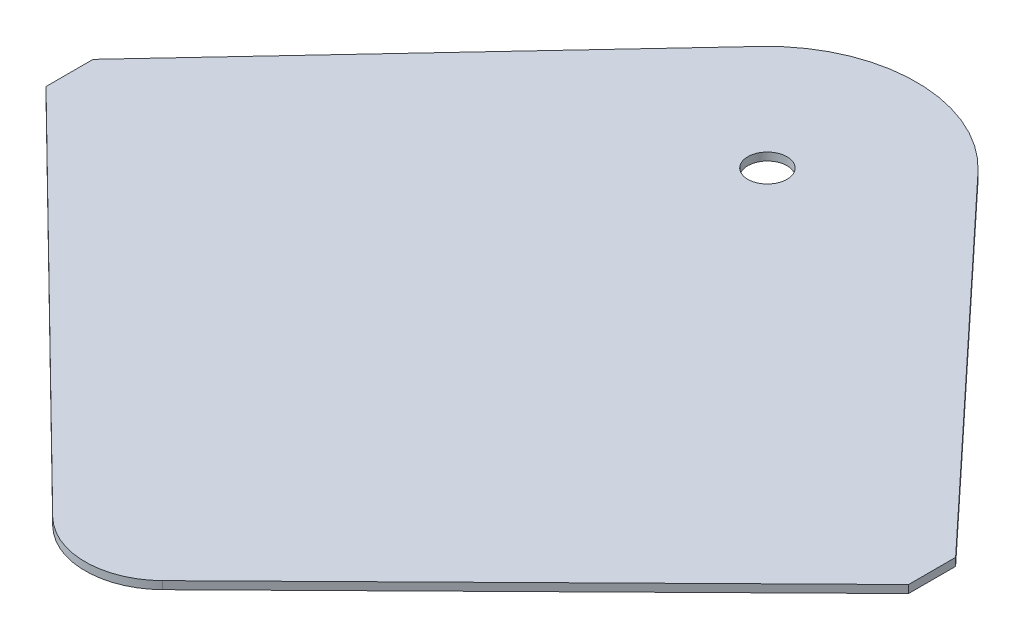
ISO-10303-21;
HEADER;
FILE_DESCRIPTION(('STEP AP214'),'2;1');
FILE_NAME('part.step','',(''),(''),'','','');
FILE_SCHEMA(('AUTOMOTIVE_DESIGN { 1 0 10303 214 1 1 1 1 }'));
ENDSEC;
DATA;
#1=APPLICATION_CONTEXT('core data for automotive mechanical design processes');
#2=APPLICATION_PROTOCOL_DEFINITION('international standard','automotive_design',2000,#1);
#3=PRODUCT_CONTEXT('',#1,'mechanical');
#4=PRODUCT('Part','Part','',(#3));
#5=PRODUCT_RELATED_PRODUCT_CATEGORY('part','',(#4));
#6=PRODUCT_DEFINITION_FORMATION('','',#4);
#7=PRODUCT_DEFINITION_CONTEXT('part definition',#1,'design');
#8=PRODUCT_DEFINITION('design','',#6,#7);
#9=PRODUCT_DEFINITION_SHAPE('','',#8);
#10=(LENGTH_UNIT() NAMED_UNIT(*) SI_UNIT(.MILLI.,.METRE.));
#11=(NAMED_UNIT(*) PLANE_ANGLE_UNIT() SI_UNIT($,.RADIAN.));
#12=(NAMED_UNIT(*) SI_UNIT($,.STERADIAN.) SOLID_ANGLE_UNIT());
#13=UNCERTAINTY_MEASURE_WITH_UNIT(LENGTH_MEASURE(1.E-05),#10,'distance_accuracy_value','');
#14=(GEOMETRIC_REPRESENTATION_CONTEXT(3) GLOBAL_UNCERTAINTY_ASSIGNED_CONTEXT((#13)) GLOBAL_UNIT_ASSIGNED_CONTEXT((#10,
#11,#12)) REPRESENTATION_CONTEXT('',''));
#15=CARTESIAN_POINT('',(0.,0.,0.));
#16=DIRECTION('',(0.,0.,1.));
#17=DIRECTION('',(1.,0.,0.));
#18=AXIS2_PLACEMENT_3D('',#15,#16,#17);
#19=CARTESIAN_POINT('',(0.,1.,-77.));
#20=DIRECTION('',(0.,1.,0.));
#21=DIRECTION('',(0.,0.,1.));
#22=AXIS2_PLACEMENT_3D('',#19,#20,#21);
#23=PLANE('',#22);
#24=DIRECTION('',(-0.683000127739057,0.,-0.73041825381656));
#25=VECTOR('',#24,1.);
#26=CARTESIAN_POINT('',(55.,1.,-46.));
#27=LINE('',#26,#25);
#28=CARTESIAN_POINT('',(55.,1.,-46.));
#29=VERTEX_POINT('',#28);
#30=CARTESIAN_POINT('',(13.8779468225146,1.,-89.9770024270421));
#31=VERTEX_POINT('',#30);
#32=EDGE_CURVE('E142',#29,#31,#27,.T.);
#33=ORIENTED_EDGE('',*,*,#32,.T.);
#34=CARTESIAN_POINT('',(0.,1.,-77.));
#35=DIRECTION('',(0.,1.,0.));
#36=DIRECTION('',(0.,0.,1.));
#37=AXIS2_PLACEMENT_3D('',#34,#35,#36);
#38=CIRCLE('',#37,19.);
#39=CARTESIAN_POINT('',(-13.8779468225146,1.,-89.9770024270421));
#40=VERTEX_POINT('',#39);
#41=EDGE_CURVE('E90',#31,#40,#38,.T.);
#42=ORIENTED_EDGE('',*,*,#41,.T.);
#43=DIRECTION('',(-0.683000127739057,0.,0.730418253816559));
#44=VECTOR('',#43,1.);
#45=CARTESIAN_POINT('',(-55.,1.,-46.));
#46=LINE('',#45,#44);
#47=CARTESIAN_POINT('',(-55.,1.,-46.));
#48=VERTEX_POINT('',#47);
#49=EDGE_CURVE('E157',#40,#48,#46,.T.);
#50=ORIENTED_EDGE('',*,*,#49,.T.);
#51=DIRECTION('',(0.,0.,1.));
#52=VECTOR('',#51,1.);
#53=CARTESIAN_POINT('',(-55.,1.,-46.));
#54=LINE('',#53,#52);
#55=CARTESIAN_POINT('',(-55.,1.,-40.));
#56=VERTEX_POINT('',#55);
#57=EDGE_CURVE('E170',#48,#56,#54,.T.);
#58=ORIENTED_EDGE('',*,*,#57,.T.);
#59=DIRECTION('',(0.713458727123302,0.,0.700697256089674));
#60=VECTOR('',#59,1.);
#61=CARTESIAN_POINT('',(-55.,1.,-40.));
#62=LINE('',#61,#60);
#63=CARTESIAN_POINT('',(-7.00697256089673,1.,7.13458727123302));
#64=VERTEX_POINT('',#63);
#65=EDGE_CURVE('E109',#56,#64,#62,.T.);
#66=ORIENTED_EDGE('',*,*,#65,.T.);
#67=CARTESIAN_POINT('',(0.,1.,0.));
#68=DIRECTION('',(0.,1.,0.));
#69=DIRECTION('',(0.,0.,1.));
#70=AXIS2_PLACEMENT_3D('',#67,#68,#69);
#71=CIRCLE('',#70,9.99999999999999);
#72=CARTESIAN_POINT('',(7.00697256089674,1.,7.13458727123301));
#73=VERTEX_POINT('',#72);
#74=EDGE_CURVE('E103',#64,#73,#71,.T.);
#75=ORIENTED_EDGE('',*,*,#74,.T.);
#76=DIRECTION('',(0.713458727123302,0.,-0.700697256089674));
#77=VECTOR('',#76,1.);
#78=CARTESIAN_POINT('',(55.,1.,-40.));
#79=LINE('',#78,#77);
#80=CARTESIAN_POINT('',(55.,1.,-40.));
#81=VERTEX_POINT('',#80);
#82=EDGE_CURVE('E107',#73,#81,#79,.T.);
#83=ORIENTED_EDGE('',*,*,#82,.T.);
#84=DIRECTION('',(0.,0.,-1.));
#85=VECTOR('',#84,1.);
#86=CARTESIAN_POINT('',(55.,1.,-46.));
#87=LINE('',#86,#85);
#88=EDGE_CURVE('E47',#81,#29,#87,.T.);
#89=ORIENTED_EDGE('',*,*,#88,.T.);
#90=EDGE_LOOP('',(#33,#42,#50,#58,#66,#75,#83,#89));
#91=FACE_BOUND('',#90,.T.);
#92=CARTESIAN_POINT('',(0.,1.,-77.));
#93=DIRECTION('',(0.,1.,0.));
#94=DIRECTION('',(0.,0.,1.));
#95=AXIS2_PLACEMENT_3D('',#92,#93,#94);
#96=CIRCLE('',#95,2.5);
#97=CARTESIAN_POINT('',(0.,1.,-74.5));
#98=VERTEX_POINT('',#97);
#99=EDGE_CURVE('E131',#98,#98,#96,.T.);
#100=ORIENTED_EDGE('',*,*,#99,.F.);
#101=EDGE_LOOP('',(#100));
#102=FACE_BOUND('',#101,.T.);
#103=ADVANCED_FACE('F30',(#91,#102),#23,.T.);
#104=CARTESIAN_POINT('',(0.,0.,-77.));
#105=DIRECTION('',(0.,1.,0.));
#106=DIRECTION('',(0.,0.,1.));
#107=AXIS2_PLACEMENT_3D('',#104,#105,#106);
#108=PLANE('',#107);
#109=DIRECTION('',(-0.683000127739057,0.,-0.73041825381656));
#110=VECTOR('',#109,1.);
#111=CARTESIAN_POINT('',(55.,0.,-46.));
#112=LINE('',#111,#110);
#113=CARTESIAN_POINT('',(55.,0.,-46.));
#114=VERTEX_POINT('',#113);
#115=CARTESIAN_POINT('',(13.8779468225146,0.,-89.9770024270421));
#116=VERTEX_POINT('',#115);
#117=EDGE_CURVE('E127',#114,#116,#112,.T.);
#118=ORIENTED_EDGE('',*,*,#117,.F.);
#119=DIRECTION('',(0.,0.,-1.));
#120=VECTOR('',#119,1.);
#121=CARTESIAN_POINT('',(55.,0.,-46.));
#122=LINE('',#121,#120);
#123=CARTESIAN_POINT('',(55.,0.,-40.));
#124=VERTEX_POINT('',#123);
#125=EDGE_CURVE('E82',#124,#114,#122,.T.);
#126=ORIENTED_EDGE('',*,*,#125,.F.);
#127=DIRECTION('',(0.713458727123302,0.,-0.700697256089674));
#128=VECTOR('',#127,1.);
#129=CARTESIAN_POINT('',(55.,0.,-40.));
#130=LINE('',#129,#128);
#131=CARTESIAN_POINT('',(7.00697256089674,0.,7.13458727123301));
#132=VERTEX_POINT('',#131);
#133=EDGE_CURVE('E76',#132,#124,#130,.T.);
#134=ORIENTED_EDGE('',*,*,#133,.F.);
#135=CARTESIAN_POINT('',(0.,0.,0.));
#136=DIRECTION('',(0.,1.,0.));
#137=DIRECTION('',(0.,0.,1.));
#138=AXIS2_PLACEMENT_3D('',#135,#136,#137);
#139=CIRCLE('',#138,9.99999999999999);
#140=CARTESIAN_POINT('',(-7.00697256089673,0.,7.13458727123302));
#141=VERTEX_POINT('',#140);
#142=EDGE_CURVE('E117',#141,#132,#139,.T.);
#143=ORIENTED_EDGE('',*,*,#142,.F.);
#144=DIRECTION('',(0.713458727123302,0.,0.700697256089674));
#145=VECTOR('',#144,1.);
#146=CARTESIAN_POINT('',(-55.,0.,-40.));
#147=LINE('',#146,#145);
#148=CARTESIAN_POINT('',(-55.,0.,-40.));
#149=VERTEX_POINT('',#148);
#150=EDGE_CURVE('E137',#149,#141,#147,.T.);
#151=ORIENTED_EDGE('',*,*,#150,.F.);
#152=DIRECTION('',(0.,0.,1.));
#153=VECTOR('',#152,1.);
#154=CARTESIAN_POINT('',(-55.,0.,-46.));
#155=LINE('',#154,#153);
#156=CARTESIAN_POINT('',(-55.,0.,-46.));
#157=VERTEX_POINT('',#156);
#158=EDGE_CURVE('E135',#157,#149,#155,.T.);
#159=ORIENTED_EDGE('',*,*,#158,.F.);
#160=DIRECTION('',(-0.683000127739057,0.,0.730418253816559));
#161=VECTOR('',#160,1.);
#162=CARTESIAN_POINT('',(-55.,0.,-46.));
#163=LINE('',#162,#161);
#164=CARTESIAN_POINT('',(-13.8779468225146,0.,-89.9770024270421));
#165=VERTEX_POINT('',#164);
#166=EDGE_CURVE('E133',#165,#157,#163,.T.);
#167=ORIENTED_EDGE('',*,*,#166,.F.);
#168=CARTESIAN_POINT('',(0.,0.,-77.));
#169=DIRECTION('',(0.,1.,0.));
#170=DIRECTION('',(0.,0.,1.));
#171=AXIS2_PLACEMENT_3D('',#168,#169,#170);
#172=CIRCLE('',#171,19.);
#173=EDGE_CURVE('E130',#116,#165,#172,.T.);
#174=ORIENTED_EDGE('',*,*,#173,.F.);
#175=EDGE_LOOP('',(#118,#126,#134,#143,#151,#159,#167,#174));
#176=FACE_BOUND('',#175,.T.);
#177=CARTESIAN_POINT('',(0.,0.,-77.));
#178=DIRECTION('',(0.,1.,0.));
#179=DIRECTION('',(0.,0.,1.));
#180=AXIS2_PLACEMENT_3D('',#177,#178,#179);
#181=CIRCLE('',#180,2.5);
#182=CARTESIAN_POINT('',(0.,0.,-74.5));
#183=VERTEX_POINT('',#182);
#184=EDGE_CURVE('E176',#183,#183,#181,.T.);
#185=ORIENTED_EDGE('',*,*,#184,.T.);
#186=EDGE_LOOP('',(#185));
#187=FACE_BOUND('',#186,.T.);
#188=ADVANCED_FACE('F161',(#176,#187),#108,.F.);
#189=CARTESIAN_POINT('',(55.,1.,-46.));
#190=DIRECTION('',(-0.73041825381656,0.,0.683000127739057));
#191=DIRECTION('',(0.683000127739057,0.,0.73041825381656));
#192=AXIS2_PLACEMENT_3D('',#189,#190,#191);
#193=PLANE('',#192);
#194=ORIENTED_EDGE('',*,*,#117,.T.);
#195=DIRECTION('',(0.,-1.,0.));
#196=VECTOR('',#195,1.);
#197=CARTESIAN_POINT('',(13.8779468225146,1.,-89.9770024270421));
#198=LINE('',#197,#196);
#199=EDGE_CURVE('E11',#31,#116,#198,.T.);
#200=ORIENTED_EDGE('',*,*,#199,.F.);
#201=ORIENTED_EDGE('',*,*,#32,.F.);
#202=DIRECTION('',(0.,-1.,0.));
#203=VECTOR('',#202,1.);
#204=CARTESIAN_POINT('',(55.,1.,-46.));
#205=LINE('',#204,#203);
#206=EDGE_CURVE('E123',#29,#114,#205,.T.);
#207=ORIENTED_EDGE('',*,*,#206,.T.);
#208=EDGE_LOOP('',(#194,#200,#201,#207));
#209=FACE_BOUND('',#208,.T.);
#210=ADVANCED_FACE('F32',(#209),#193,.F.);
#211=CARTESIAN_POINT('',(0.,1.,-77.));
#212=DIRECTION('',(0.,-1.,0.));
#213=DIRECTION('',(0.,0.,-1.));
#214=AXIS2_PLACEMENT_3D('',#211,#212,#213);
#215=CYLINDRICAL_SURFACE('',#214,19.);
#216=ORIENTED_EDGE('',*,*,#173,.T.);
#217=DIRECTION('',(0.,-1.,0.));
#218=VECTOR('',#217,1.);
#219=CARTESIAN_POINT('',(-13.8779468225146,1.,-89.9770024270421));
#220=LINE('',#219,#218);
#221=EDGE_CURVE('E39',#40,#165,#220,.T.);
#222=ORIENTED_EDGE('',*,*,#221,.F.);
#223=ORIENTED_EDGE('',*,*,#41,.F.);
#224=ORIENTED_EDGE('',*,*,#199,.T.);
#225=EDGE_LOOP('',(#216,#222,#223,#224));
#226=FACE_BOUND('',#225,.T.);
#227=ADVANCED_FACE('F204',(#226),#215,.T.);
#228=CARTESIAN_POINT('',(-55.,1.,-46.));
#229=DIRECTION('',(0.730418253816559,0.,0.683000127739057));
#230=DIRECTION('',(0.683000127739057,0.,-0.730418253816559));
#231=AXIS2_PLACEMENT_3D('',#228,#229,#230);
#232=PLANE('',#231);
#233=ORIENTED_EDGE('',*,*,#166,.T.);
#234=DIRECTION('',(0.,-1.,0.));
#235=VECTOR('',#234,1.);
#236=CARTESIAN_POINT('',(-55.,1.,-46.));
#237=LINE('',#236,#235);
#238=EDGE_CURVE('E149',#48,#157,#237,.T.);
#239=ORIENTED_EDGE('',*,*,#238,.F.);
#240=ORIENTED_EDGE('',*,*,#49,.F.);
#241=ORIENTED_EDGE('',*,*,#221,.T.);
#242=EDGE_LOOP('',(#233,#239,#240,#241));
#243=FACE_BOUND('',#242,.T.);
#244=ADVANCED_FACE('F155',(#243),#232,.F.);
#245=CARTESIAN_POINT('',(-55.,1.,-46.));
#246=DIRECTION('',(1.,0.,0.));
#247=DIRECTION('',(0.,0.,-1.));
#248=AXIS2_PLACEMENT_3D('',#245,#246,#247);
#249=PLANE('',#248);
#250=ORIENTED_EDGE('',*,*,#158,.T.);
#251=DIRECTION('',(0.,-1.,0.));
#252=VECTOR('',#251,1.);
#253=CARTESIAN_POINT('',(-55.,1.,-40.));
#254=LINE('',#253,#252);
#255=EDGE_CURVE('E146',#56,#149,#254,.T.);
#256=ORIENTED_EDGE('',*,*,#255,.F.);
#257=ORIENTED_EDGE('',*,*,#57,.F.);
#258=ORIENTED_EDGE('',*,*,#238,.T.);
#259=EDGE_LOOP('',(#250,#256,#257,#258));
#260=FACE_BOUND('',#259,.T.);
#261=ADVANCED_FACE('F166',(#260),#249,.F.);
#262=CARTESIAN_POINT('',(-55.,1.,-40.));
#263=DIRECTION('',(0.700697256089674,0.,-0.713458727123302));
#264=DIRECTION('',(-0.713458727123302,0.,-0.700697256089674));
#265=AXIS2_PLACEMENT_3D('',#262,#263,#264);
#266=PLANE('',#265);
#267=ORIENTED_EDGE('',*,*,#150,.T.);
#268=DIRECTION('',(0.,-1.,0.));
#269=VECTOR('',#268,1.);
#270=CARTESIAN_POINT('',(-7.00697256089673,1.,7.13458727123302));
#271=LINE('',#270,#269);
#272=EDGE_CURVE('E118',#64,#141,#271,.T.);
#273=ORIENTED_EDGE('',*,*,#272,.F.);
#274=ORIENTED_EDGE('',*,*,#65,.F.);
#275=ORIENTED_EDGE('',*,*,#255,.T.);
#276=EDGE_LOOP('',(#267,#273,#274,#275));
#277=FACE_BOUND('',#276,.T.);
#278=ADVANCED_FACE('F169',(#277),#266,.F.);
#279=CARTESIAN_POINT('',(0.,1.,0.));
#280=DIRECTION('',(0.,-1.,0.));
#281=DIRECTION('',(0.,0.,-1.));
#282=AXIS2_PLACEMENT_3D('',#279,#280,#281);
#283=CYLINDRICAL_SURFACE('',#282,9.99999999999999);
#284=ORIENTED_EDGE('',*,*,#142,.T.);
#285=DIRECTION('',(0.,-1.,0.));
#286=VECTOR('',#285,1.);
#287=CARTESIAN_POINT('',(7.00697256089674,1.,7.13458727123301));
#288=LINE('',#287,#286);
#289=EDGE_CURVE('E114',#73,#132,#288,.T.);
#290=ORIENTED_EDGE('',*,*,#289,.F.);
#291=ORIENTED_EDGE('',*,*,#74,.F.);
#292=ORIENTED_EDGE('',*,*,#272,.T.);
#293=EDGE_LOOP('',(#284,#290,#291,#292));
#294=FACE_BOUND('',#293,.T.);
#295=ADVANCED_FACE('F115',(#294),#283,.T.);
#296=CARTESIAN_POINT('',(55.,1.,-40.));
#297=DIRECTION('',(-0.700697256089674,0.,-0.713458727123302));
#298=DIRECTION('',(-0.713458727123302,0.,0.700697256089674));
#299=AXIS2_PLACEMENT_3D('',#296,#297,#298);
#300=PLANE('',#299);
#301=ORIENTED_EDGE('',*,*,#133,.T.);
#302=DIRECTION('',(0.,-1.,0.));
#303=VECTOR('',#302,1.);
#304=CARTESIAN_POINT('',(55.,1.,-40.));
#305=LINE('',#304,#303);
#306=EDGE_CURVE('E119',#81,#124,#305,.T.);
#307=ORIENTED_EDGE('',*,*,#306,.F.);
#308=ORIENTED_EDGE('',*,*,#82,.F.);
#309=ORIENTED_EDGE('',*,*,#289,.T.);
#310=EDGE_LOOP('',(#301,#307,#308,#309));
#311=FACE_BOUND('',#310,.T.);
#312=ADVANCED_FACE('F121',(#311),#300,.F.);
#313=CARTESIAN_POINT('',(55.,1.,-46.));
#314=DIRECTION('',(-1.,0.,0.));
#315=DIRECTION('',(0.,0.,1.));
#316=AXIS2_PLACEMENT_3D('',#313,#314,#315);
#317=PLANE('',#316);
#318=ORIENTED_EDGE('',*,*,#125,.T.);
#319=ORIENTED_EDGE('',*,*,#206,.F.);
#320=ORIENTED_EDGE('',*,*,#88,.F.);
#321=ORIENTED_EDGE('',*,*,#306,.T.);
#322=EDGE_LOOP('',(#318,#319,#320,#321));
#323=FACE_BOUND('',#322,.T.);
#324=ADVANCED_FACE('F192',(#323),#317,.F.);
#325=CARTESIAN_POINT('',(0.,1.,-77.));
#326=DIRECTION('',(0.,-1.,0.));
#327=DIRECTION('',(0.,0.,-1.));
#328=AXIS2_PLACEMENT_3D('',#325,#326,#327);
#329=CYLINDRICAL_SURFACE('',#328,2.5);
#330=ORIENTED_EDGE('',*,*,#99,.T.);
#331=EDGE_LOOP('',(#330));
#332=FACE_BOUND('',#331,.T.);
#333=ORIENTED_EDGE('',*,*,#184,.F.);
#334=EDGE_LOOP('',(#333));
#335=FACE_BOUND('',#334,.T.);
#336=ADVANCED_FACE('F182',(#332,#335),#329,.F.);
#337=CLOSED_SHELL('',(#103,#188,#210,#227,#244,#261,#278,#295,#312,#324,#336));
#338=MANIFOLD_SOLID_BREP('B2',#337);
#339=ADVANCED_BREP_SHAPE_REPRESENTATION('',(#18,#338),#14);
#340=SHAPE_DEFINITION_REPRESENTATION(#9,#339);
ENDSEC;
END-ISO-10303-21;
